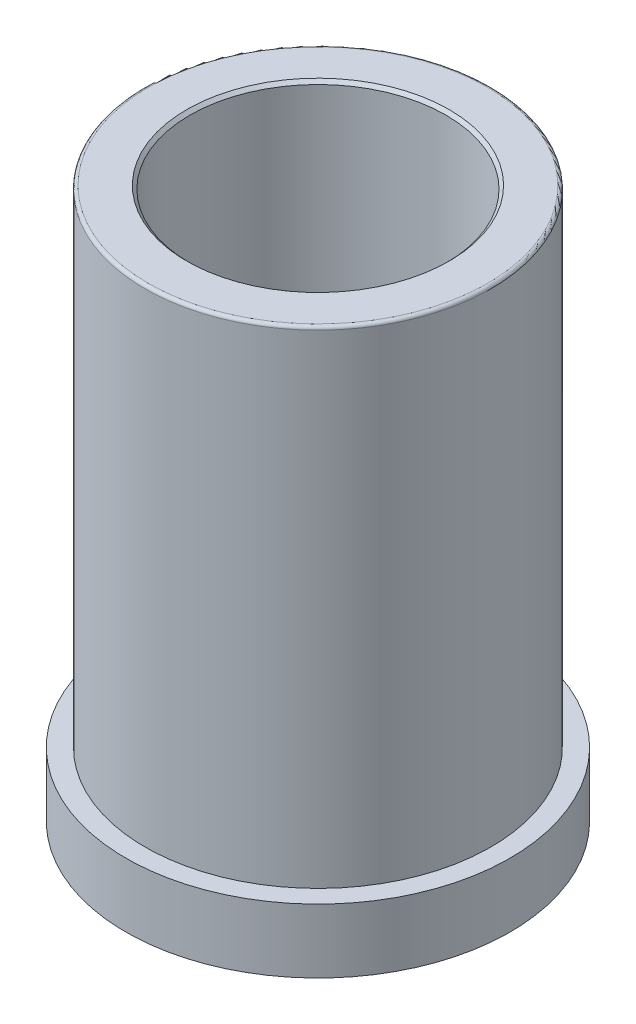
ISO-10303-21;
HEADER;
FILE_DESCRIPTION(('STEP AP214'),'2;1');
FILE_NAME('part.step','',(''),(''),'','','');
FILE_SCHEMA(('AUTOMOTIVE_DESIGN { 1 0 10303 214 1 1 1 1 }'));
ENDSEC;
DATA;
#1=APPLICATION_CONTEXT('core data for automotive mechanical design processes');
#2=APPLICATION_PROTOCOL_DEFINITION('international standard','automotive_design',2000,#1);
#3=PRODUCT_CONTEXT('',#1,'mechanical');
#4=PRODUCT('Part','Part','',(#3));
#5=PRODUCT_RELATED_PRODUCT_CATEGORY('part','',(#4));
#6=PRODUCT_DEFINITION_FORMATION('','',#4);
#7=PRODUCT_DEFINITION_CONTEXT('part definition',#1,'design');
#8=PRODUCT_DEFINITION('design','',#6,#7);
#9=PRODUCT_DEFINITION_SHAPE('','',#8);
#10=(LENGTH_UNIT() NAMED_UNIT(*) SI_UNIT(.MILLI.,.METRE.));
#11=(NAMED_UNIT(*) PLANE_ANGLE_UNIT() SI_UNIT($,.RADIAN.));
#12=(NAMED_UNIT(*) SI_UNIT($,.STERADIAN.) SOLID_ANGLE_UNIT());
#13=UNCERTAINTY_MEASURE_WITH_UNIT(LENGTH_MEASURE(1.E-05),#10,'distance_accuracy_value','');
#14=(GEOMETRIC_REPRESENTATION_CONTEXT(3) GLOBAL_UNCERTAINTY_ASSIGNED_CONTEXT((#13)) GLOBAL_UNIT_ASSIGNED_CONTEXT((#10,
#11,#12)) REPRESENTATION_CONTEXT('',''));
#15=CARTESIAN_POINT('',(0.,0.,0.));
#16=DIRECTION('',(0.,0.,1.));
#17=DIRECTION('',(1.,0.,0.));
#18=AXIS2_PLACEMENT_3D('',#15,#16,#17);
#19=CARTESIAN_POINT('',(0.,0.,0.));
#20=DIRECTION('',(0.,-1.,0.));
#21=DIRECTION('',(0.,0.,-1.));
#22=AXIS2_PLACEMENT_3D('',#19,#20,#21);
#23=CYLINDRICAL_SURFACE('',#22,27.);
#24=CARTESIAN_POINT('',(0.,75.5,0.));
#25=DIRECTION('',(0.,-1.,0.));
#26=DIRECTION('',(0.,0.,-1.));
#27=AXIS2_PLACEMENT_3D('',#24,#25,#26);
#28=CIRCLE('',#27,27.);
#29=CARTESIAN_POINT('',(0.,75.5,-27.));
#30=VERTEX_POINT('',#29);
#31=EDGE_CURVE('E21',#30,#30,#28,.T.);
#32=ORIENTED_EDGE('',*,*,#31,.T.);
#33=EDGE_LOOP('',(#32));
#34=FACE_BOUND('',#33,.T.);
#35=CARTESIAN_POINT('',(0.,0.,0.));
#36=DIRECTION('',(0.,-1.,0.));
#37=DIRECTION('',(0.,0.,-1.));
#38=AXIS2_PLACEMENT_3D('',#35,#36,#37);
#39=CIRCLE('',#38,27.);
#40=CARTESIAN_POINT('',(0.,0.,-27.));
#41=VERTEX_POINT('',#40);
#42=EDGE_CURVE('E52',#41,#41,#39,.T.);
#43=ORIENTED_EDGE('',*,*,#42,.F.);
#44=EDGE_LOOP('',(#43));
#45=FACE_BOUND('',#44,.T.);
#46=ADVANCED_FACE('F14',(#34,#45),#23,.T.);
#47=CARTESIAN_POINT('',(-27.,76.,0.));
#48=DIRECTION('',(0.,-1.,0.));
#49=DIRECTION('',(0.,0.,-1.));
#50=AXIS2_PLACEMENT_3D('',#47,#48,#49);
#51=PLANE('',#50);
#52=CARTESIAN_POINT('',(0.,76.,0.));
#53=DIRECTION('',(0.,-1.,0.));
#54=DIRECTION('',(0.,0.,-1.));
#55=AXIS2_PLACEMENT_3D('',#52,#53,#54);
#56=CIRCLE('',#55,26.5);
#57=CARTESIAN_POINT('',(0.,76.,-26.5));
#58=VERTEX_POINT('',#57);
#59=EDGE_CURVE('E9',#58,#58,#56,.F.);
#60=ORIENTED_EDGE('',*,*,#59,.T.);
#61=EDGE_LOOP('',(#60));
#62=FACE_BOUND('',#61,.T.);
#63=CARTESIAN_POINT('',(0.,76.,0.));
#64=DIRECTION('',(0.,-1.,0.));
#65=DIRECTION('',(0.,0.,-1.));
#66=AXIS2_PLACEMENT_3D('',#63,#64,#65);
#67=CIRCLE('',#66,20.5);
#68=CARTESIAN_POINT('',(0.,76.,-20.5));
#69=VERTEX_POINT('',#68);
#70=EDGE_CURVE('E37',#69,#69,#67,.T.);
#71=ORIENTED_EDGE('',*,*,#70,.T.);
#72=EDGE_LOOP('',(#71));
#73=FACE_BOUND('',#72,.T.);
#74=ADVANCED_FACE('F59',(#62,#73),#51,.F.);
#75=CARTESIAN_POINT('',(0.,0.,0.));
#76=DIRECTION('',(0.,-1.,0.));
#77=DIRECTION('',(0.,0.,-1.));
#78=AXIS2_PLACEMENT_3D('',#75,#76,#77);
#79=CYLINDRICAL_SURFACE('',#78,20.);
#80=CARTESIAN_POINT('',(0.,75.5,0.));
#81=DIRECTION('',(0.,-1.,0.));
#82=DIRECTION('',(0.,0.,-1.));
#83=AXIS2_PLACEMENT_3D('',#80,#81,#82);
#84=CIRCLE('',#83,20.);
#85=CARTESIAN_POINT('',(0.,75.5,-20.));
#86=VERTEX_POINT('',#85);
#87=EDGE_CURVE('E34',#86,#86,#84,.F.);
#88=ORIENTED_EDGE('',*,*,#87,.T.);
#89=EDGE_LOOP('',(#88));
#90=FACE_BOUND('',#89,.T.);
#91=CARTESIAN_POINT('',(0.,0.,0.));
#92=DIRECTION('',(0.,-1.,0.));
#93=DIRECTION('',(0.,0.,-1.));
#94=AXIS2_PLACEMENT_3D('',#91,#92,#93);
#95=CIRCLE('',#94,20.);
#96=CARTESIAN_POINT('',(0.,0.,-20.));
#97=VERTEX_POINT('',#96);
#98=EDGE_CURVE('E40',#97,#97,#95,.T.);
#99=ORIENTED_EDGE('',*,*,#98,.T.);
#100=EDGE_LOOP('',(#99));
#101=FACE_BOUND('',#100,.T.);
#102=ADVANCED_FACE('F66',(#90,#101),#79,.F.);
#103=CARTESIAN_POINT('',(0.,-0.15,0.));
#104=DIRECTION('',(0.,-1.,0.));
#105=DIRECTION('',(0.,0.,-1.));
#106=AXIS2_PLACEMENT_3D('',#103,#104,#105);
#107=CONICAL_SURFACE('',#106,20.1,0.588002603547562);
#108=ORIENTED_EDGE('',*,*,#98,.F.);
#109=EDGE_LOOP('',(#108));
#110=FACE_BOUND('',#109,.T.);
#111=CARTESIAN_POINT('',(0.,-0.15,0.));
#112=DIRECTION('',(0.,-1.,0.));
#113=DIRECTION('',(0.,0.,-1.));
#114=AXIS2_PLACEMENT_3D('',#111,#112,#113);
#115=CIRCLE('',#114,20.1);
#116=CARTESIAN_POINT('',(0.,-0.15,-20.1));
#117=VERTEX_POINT('',#116);
#118=EDGE_CURVE('E43',#117,#117,#115,.T.);
#119=ORIENTED_EDGE('',*,*,#118,.T.);
#120=EDGE_LOOP('',(#119));
#121=FACE_BOUND('',#120,.T.);
#122=ADVANCED_FACE('F89',(#110,#121),#107,.F.);
#123=CARTESIAN_POINT('',(0.,0.,0.));
#124=DIRECTION('',(0.,-1.,0.));
#125=DIRECTION('',(0.,0.,-1.));
#126=AXIS2_PLACEMENT_3D('',#123,#124,#125);
#127=CYLINDRICAL_SURFACE('',#126,20.1);
#128=CARTESIAN_POINT('',(0.,-9.5,0.));
#129=DIRECTION('',(0.,1.,0.));
#130=DIRECTION('',(0.,0.,1.));
#131=AXIS2_PLACEMENT_3D('',#128,#129,#130);
#132=CIRCLE('',#131,20.1);
#133=CARTESIAN_POINT('',(0.,-9.5,20.1));
#134=VERTEX_POINT('',#133);
#135=EDGE_CURVE('E29',#134,#134,#132,.F.);
#136=ORIENTED_EDGE('',*,*,#135,.T.);
#137=EDGE_LOOP('',(#136));
#138=FACE_BOUND('',#137,.T.);
#139=ORIENTED_EDGE('',*,*,#118,.F.);
#140=EDGE_LOOP('',(#139));
#141=FACE_BOUND('',#140,.T.);
#142=ADVANCED_FACE('F85',(#138,#141),#127,.F.);
#143=CARTESIAN_POINT('',(-20.1,-10.,0.));
#144=DIRECTION('',(0.,1.,0.));
#145=DIRECTION('',(0.,0.,1.));
#146=AXIS2_PLACEMENT_3D('',#143,#144,#145);
#147=PLANE('',#146);
#148=CARTESIAN_POINT('',(0.,-10.,0.));
#149=DIRECTION('',(0.,1.,0.));
#150=DIRECTION('',(0.,0.,1.));
#151=AXIS2_PLACEMENT_3D('',#148,#149,#150);
#152=CIRCLE('',#151,20.6);
#153=CARTESIAN_POINT('',(0.,-10.,20.6));
#154=VERTEX_POINT('',#153);
#155=EDGE_CURVE('E25',#154,#154,#152,.T.);
#156=ORIENTED_EDGE('',*,*,#155,.T.);
#157=EDGE_LOOP('',(#156));
#158=FACE_BOUND('',#157,.T.);
#159=CARTESIAN_POINT('',(0.,-10.,0.));
#160=DIRECTION('',(0.,-1.,0.));
#161=DIRECTION('',(0.,0.,-1.));
#162=AXIS2_PLACEMENT_3D('',#159,#160,#161);
#163=CIRCLE('',#162,30.);
#164=CARTESIAN_POINT('',(0.,-10.,-30.));
#165=VERTEX_POINT('',#164);
#166=EDGE_CURVE('E46',#165,#165,#163,.T.);
#167=ORIENTED_EDGE('',*,*,#166,.T.);
#168=EDGE_LOOP('',(#167));
#169=FACE_BOUND('',#168,.T.);
#170=ADVANCED_FACE('F88',(#158,#169),#147,.F.);
#171=CARTESIAN_POINT('',(0.,0.,0.));
#172=DIRECTION('',(0.,-1.,0.));
#173=DIRECTION('',(0.,0.,-1.));
#174=AXIS2_PLACEMENT_3D('',#171,#172,#173);
#175=CYLINDRICAL_SURFACE('',#174,30.);
#176=ORIENTED_EDGE('',*,*,#166,.F.);
#177=EDGE_LOOP('',(#176));
#178=FACE_BOUND('',#177,.T.);
#179=CARTESIAN_POINT('',(0.,0.,0.));
#180=DIRECTION('',(0.,-1.,0.));
#181=DIRECTION('',(0.,0.,-1.));
#182=AXIS2_PLACEMENT_3D('',#179,#180,#181);
#183=CIRCLE('',#182,30.);
#184=CARTESIAN_POINT('',(0.,0.,-30.));
#185=VERTEX_POINT('',#184);
#186=EDGE_CURVE('E49',#185,#185,#183,.T.);
#187=ORIENTED_EDGE('',*,*,#186,.T.);
#188=EDGE_LOOP('',(#187));
#189=FACE_BOUND('',#188,.T.);
#190=ADVANCED_FACE('F105',(#178,#189),#175,.T.);
#191=CARTESIAN_POINT('',(-30.,0.,0.));
#192=DIRECTION('',(0.,-1.,0.));
#193=DIRECTION('',(0.,0.,-1.));
#194=AXIS2_PLACEMENT_3D('',#191,#192,#193);
#195=PLANE('',#194);
#196=ORIENTED_EDGE('',*,*,#186,.F.);
#197=EDGE_LOOP('',(#196));
#198=FACE_BOUND('',#197,.T.);
#199=ORIENTED_EDGE('',*,*,#42,.T.);
#200=EDGE_LOOP('',(#199));
#201=FACE_BOUND('',#200,.T.);
#202=ADVANCED_FACE('F56',(#198,#201),#195,.F.);
#203=CARTESIAN_POINT('',(0.,76.,0.));
#204=DIRECTION('',(0.,1.,0.));
#205=DIRECTION('',(0.,0.,1.));
#206=AXIS2_PLACEMENT_3D('',#203,#204,#205);
#207=CONICAL_SURFACE('',#206,20.5,0.785398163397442);
#208=ORIENTED_EDGE('',*,*,#87,.F.);
#209=EDGE_LOOP('',(#208));
#210=FACE_BOUND('',#209,.T.);
#211=ORIENTED_EDGE('',*,*,#70,.F.);
#212=EDGE_LOOP('',(#211));
#213=FACE_BOUND('',#212,.T.);
#214=ADVANCED_FACE('F70',(#210,#213),#207,.F.);
#215=CARTESIAN_POINT('',(0.,-9.5,0.));
#216=DIRECTION('',(0.,-1.,0.));
#217=DIRECTION('',(0.,0.,-1.));
#218=AXIS2_PLACEMENT_3D('',#215,#216,#217);
#219=CONICAL_SURFACE('',#218,20.1,0.785398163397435);
#220=ORIENTED_EDGE('',*,*,#155,.F.);
#221=EDGE_LOOP('',(#220));
#222=FACE_BOUND('',#221,.T.);
#223=ORIENTED_EDGE('',*,*,#135,.F.);
#224=EDGE_LOOP('',(#223));
#225=FACE_BOUND('',#224,.T.);
#226=ADVANCED_FACE('F72',(#222,#225),#219,.F.);
#227=CARTESIAN_POINT('',(0.,75.5,0.));
#228=DIRECTION('',(0.,-1.,0.));
#229=DIRECTION('',(0.,0.,-1.));
#230=AXIS2_PLACEMENT_3D('',#227,#228,#229);
#231=TOROIDAL_SURFACE('',#230,26.5,0.5);
#232=ORIENTED_EDGE('',*,*,#59,.F.);
#233=EDGE_LOOP('',(#232));
#234=FACE_BOUND('',#233,.T.);
#235=ORIENTED_EDGE('',*,*,#31,.F.);
#236=EDGE_LOOP('',(#235));
#237=FACE_BOUND('',#236,.T.);
#238=ADVANCED_FACE('F16',(#234,#237),#231,.T.);
#239=CLOSED_SHELL('',(#46,#74,#102,#122,#142,#170,#190,#202,#214,#226,#238));
#240=MANIFOLD_SOLID_BREP('B1',#239);
#241=ADVANCED_BREP_SHAPE_REPRESENTATION('',(#18,#240),#14);
#242=SHAPE_DEFINITION_REPRESENTATION(#9,#241);
ENDSEC;
END-ISO-10303-21;
